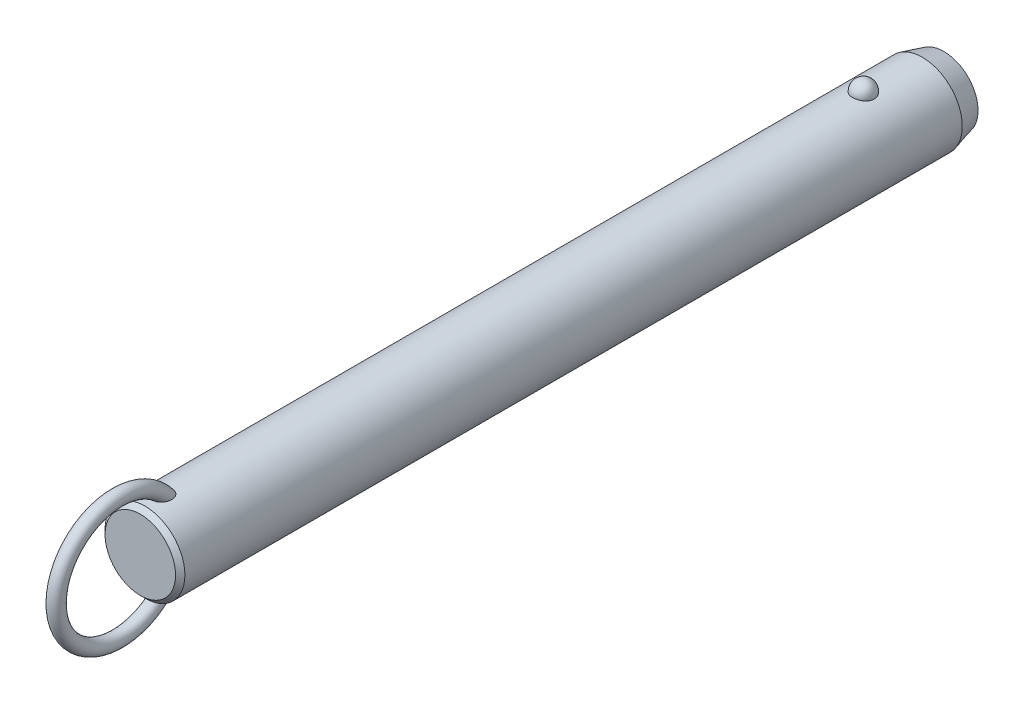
ISO-10303-21;
HEADER;
FILE_DESCRIPTION(('STEP AP214'),'2;1');
FILE_NAME('part.step','',(''),(''),'','','');
FILE_SCHEMA(('AUTOMOTIVE_DESIGN { 1 0 10303 214 1 1 1 1 }'));
ENDSEC;
DATA;
#1=APPLICATION_CONTEXT('core data for automotive mechanical design processes');
#2=APPLICATION_PROTOCOL_DEFINITION('international standard','automotive_design',2000,#1);
#3=PRODUCT_CONTEXT('',#1,'mechanical');
#4=PRODUCT('Part','Part','',(#3));
#5=PRODUCT_RELATED_PRODUCT_CATEGORY('part','',(#4));
#6=PRODUCT_DEFINITION_FORMATION('','',#4);
#7=PRODUCT_DEFINITION_CONTEXT('part definition',#1,'design');
#8=PRODUCT_DEFINITION('design','',#6,#7);
#9=PRODUCT_DEFINITION_SHAPE('','',#8);
#10=(LENGTH_UNIT() NAMED_UNIT(*) SI_UNIT(.MILLI.,.METRE.));
#11=(NAMED_UNIT(*) PLANE_ANGLE_UNIT() SI_UNIT($,.RADIAN.));
#12=(NAMED_UNIT(*) SI_UNIT($,.STERADIAN.) SOLID_ANGLE_UNIT());
#13=UNCERTAINTY_MEASURE_WITH_UNIT(LENGTH_MEASURE(1.E-05),#10,'distance_accuracy_value','');
#14=(GEOMETRIC_REPRESENTATION_CONTEXT(3) GLOBAL_UNCERTAINTY_ASSIGNED_CONTEXT((#13)) GLOBAL_UNIT_ASSIGNED_CONTEXT((#10,
#11,#12)) REPRESENTATION_CONTEXT('',''));
#15=CARTESIAN_POINT('',(0.,0.,0.));
#16=DIRECTION('',(0.,0.,1.));
#17=DIRECTION('',(1.,0.,0.));
#18=AXIS2_PLACEMENT_3D('',#15,#16,#17);
#19=CARTESIAN_POINT('',(0.,0.,185.4));
#20=DIRECTION('',(0.,0.,-1.));
#21=DIRECTION('',(-1.,0.,0.));
#22=AXIS2_PLACEMENT_3D('',#19,#20,#21);
#23=CYLINDRICAL_SURFACE('',#22,11.1);
#24=CARTESIAN_POINT('',(2.9724815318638,10.6945945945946,-3.00000000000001));
#25=CARTESIAN_POINT('',(2.9724783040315,10.6945972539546,-2.8322505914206));
#26=CARTESIAN_POINT('',(2.95876598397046,10.6984356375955,-2.66445972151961));
#27=CARTESIAN_POINT('',(2.90424529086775,10.7133624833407,-2.3336238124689));
#28=CARTESIAN_POINT('',(2.8634252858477,10.7244540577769,-2.17058084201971));
#29=CARTESIAN_POINT('',(2.75573657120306,10.7526272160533,-1.85396767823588));
#30=CARTESIAN_POINT('',(2.68887937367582,10.7697061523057,-1.70039333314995));
#31=CARTESIAN_POINT('',(2.53079696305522,10.8079438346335,-1.4069159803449));
#32=CARTESIAN_POINT('',(2.43957264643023,10.8291024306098,-1.26701246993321));
#33=CARTESIAN_POINT('',(2.23458150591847,10.8732541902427,-1.00409565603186));
#34=CARTESIAN_POINT('',(2.12071295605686,10.8962553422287,-0.88116297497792));
#35=CARTESIAN_POINT('',(1.87365402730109,10.9414421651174,-0.656352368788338));
#36=CARTESIAN_POINT('',(1.74046358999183,10.9636278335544,-0.554474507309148));
#37=CARTESIAN_POINT('',(1.45872188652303,11.0046495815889,-0.374872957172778));
#38=CARTESIAN_POINT('',(1.31021276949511,11.0234944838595,-0.297085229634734));
#39=CARTESIAN_POINT('',(1.00170030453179,11.0557957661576,-0.167529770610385));
#40=CARTESIAN_POINT('',(0.841698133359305,11.0692526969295,-0.115759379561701));
#41=CARTESIAN_POINT('',(0.51760779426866,11.0890932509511,-0.040392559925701));
#42=CARTESIAN_POINT('',(0.353633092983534,11.0955916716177,-0.0163383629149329));
#43=CARTESIAN_POINT('',(0.0238420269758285,11.1011989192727,0.0044517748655));
#44=CARTESIAN_POINT('',(-0.141974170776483,11.1003084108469,0.00119017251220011));
#45=CARTESIAN_POINT('',(-0.468405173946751,11.0912990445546,-0.0323233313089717));
#46=CARTESIAN_POINT('',(-0.629059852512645,11.0832767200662,-0.0622147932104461));
#47=CARTESIAN_POINT('',(-0.942937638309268,11.0609962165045,-0.147645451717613));
#48=CARTESIAN_POINT('',(-1.09616062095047,11.0467379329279,-0.20318507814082));
#49=CARTESIAN_POINT('',(-1.39181061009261,11.0134071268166,-0.338752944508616));
#50=CARTESIAN_POINT('',(-1.53417383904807,10.9943086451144,-0.418913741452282));
#51=CARTESIAN_POINT('',(-1.80342160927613,10.9533667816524,-0.601448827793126));
#52=CARTESIAN_POINT('',(-1.9303046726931,10.9315231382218,-0.703825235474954));
#53=CARTESIAN_POINT('',(-2.16747598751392,10.887005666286,-0.93009164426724));
#54=CARTESIAN_POINT('',(-2.27742774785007,10.8643239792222,-1.05433291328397));
#55=CARTESIAN_POINT('',(-2.47517316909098,10.8209886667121,-1.31966633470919));
#56=CARTESIAN_POINT('',(-2.56296538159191,10.8003351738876,-1.46075958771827));
#57=CARTESIAN_POINT('',(-2.71500300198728,10.7631304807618,-1.75753646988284));
#58=CARTESIAN_POINT('',(-2.77898901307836,10.7466250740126,-1.91335887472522));
#59=CARTESIAN_POINT('',(-2.88046189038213,10.7198747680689,-2.23391529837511));
#60=CARTESIAN_POINT('',(-2.91794947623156,10.709629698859,-2.3986490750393));
#61=CARTESIAN_POINT('',(-2.96537819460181,10.6965949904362,-2.73165170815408));
#62=CARTESIAN_POINT('',(-2.97542891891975,10.693775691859,-2.89990378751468));
#63=CARTESIAN_POINT('',(-2.96804271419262,10.6958279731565,-3.23575286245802));
#64=CARTESIAN_POINT('',(-2.95060646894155,10.7006993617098,-3.4033498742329));
#65=CARTESIAN_POINT('',(-2.88883358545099,10.71753912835,-3.73233906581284));
#66=CARTESIAN_POINT('',(-2.84462026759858,10.7294749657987,-3.89375610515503));
#67=CARTESIAN_POINT('',(-2.73050447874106,10.7590797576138,-4.20667949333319));
#68=CARTESIAN_POINT('',(-2.66060103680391,10.7767489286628,-4.35818546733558));
#69=CARTESIAN_POINT('',(-2.49642559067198,10.8159599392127,-4.64785421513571));
#70=CARTESIAN_POINT('',(-2.40203047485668,10.8375211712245,-4.78594458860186));
#71=CARTESIAN_POINT('',(-2.19143488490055,10.8820570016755,-5.04410382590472));
#72=CARTESIAN_POINT('',(-2.07523364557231,10.9050316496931,-5.16417205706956));
#73=CARTESIAN_POINT('',(-1.82361254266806,10.9499219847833,-5.3833483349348));
#74=CARTESIAN_POINT('',(-1.68812945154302,10.9718338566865,-5.48238464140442));
#75=CARTESIAN_POINT('',(-1.40191298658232,11.0120611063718,-5.65618873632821));
#76=CARTESIAN_POINT('',(-1.25118062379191,11.0303767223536,-5.73095813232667));
#77=CARTESIAN_POINT('',(-0.940570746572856,11.0611653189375,-5.85334725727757));
#78=CARTESIAN_POINT('',(-0.780821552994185,11.0737044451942,-5.90127578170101));
#79=CARTESIAN_POINT('',(-0.455204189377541,11.0918598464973,-5.9699297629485));
#80=CARTESIAN_POINT('',(-0.289336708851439,11.0974768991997,-5.99065827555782));
#81=CARTESIAN_POINT('',(0.0406846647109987,11.1011307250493,-6.00418773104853));
#82=CARTESIAN_POINT('',(0.204817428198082,11.099299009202,-5.99747318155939));
#83=CARTESIAN_POINT('',(0.5295530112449,11.088551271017,-5.95740317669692));
#84=CARTESIAN_POINT('',(0.690155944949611,11.0796354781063,-5.92404858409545));
#85=CARTESIAN_POINT('',(1.0027760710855,11.0557204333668,-5.83180084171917));
#86=CARTESIAN_POINT('',(1.15482001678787,11.0407414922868,-5.7729929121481));
#87=CARTESIAN_POINT('',(1.44678373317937,11.0062913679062,-5.63147366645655));
#88=CARTESIAN_POINT('',(1.58670279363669,10.9868199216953,-5.54876095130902));
#89=CARTESIAN_POINT('',(1.8527023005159,10.9451315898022,-5.36027644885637));
#90=CARTESIAN_POINT('',(1.97855158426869,10.9228788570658,-5.25418644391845));
#91=CARTESIAN_POINT('',(2.21080872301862,10.8782509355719,-5.02251354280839));
#92=CARTESIAN_POINT('',(2.31721312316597,10.8558757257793,-4.89692718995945));
#93=CARTESIAN_POINT('',(2.50945517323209,10.8130715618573,-4.62745408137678));
#94=CARTESIAN_POINT('',(2.59493284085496,10.7926798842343,-4.48330448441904));
#95=CARTESIAN_POINT('',(2.740862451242,10.7565495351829,-4.18236358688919));
#96=CARTESIAN_POINT('',(2.80132490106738,10.7408089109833,-4.02557762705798));
#97=CARTESIAN_POINT('',(2.88959070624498,10.7173718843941,-3.72475308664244));
#98=CARTESIAN_POINT('',(2.92062102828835,10.7088950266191,-3.58171216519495));
#99=CARTESIAN_POINT('',(2.96206765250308,10.6975052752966,-3.29245795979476));
#100=CARTESIAN_POINT('',(2.97248434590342,10.6945922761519,-3.14624473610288));
#101=CARTESIAN_POINT('',(2.9724815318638,10.6945945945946,-3.00000000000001));
#102=B_SPLINE_CURVE_WITH_KNOTS('',3,(#24,#25,#26,#27,#28,#29,#30,#31,#32,#33,#34,#35,#36,#37,
#38,#39,#40,#41,#42,#43,#44,#45,#46,#47,#48,#49,#50,#51,#52,#53,#54,#55,#56,#57,#58,#59,#60,#61,
#62,#63,#64,#65,#66,#67,#68,#69,#70,#71,#72,#73,#74,#75,#76,#77,#78,#79,#80,#81,#82,#83,#84,#85,
#86,#87,#88,#89,#90,#91,#92,#93,#94,#95,#96,#97,#98,#99,#100,#101),.UNSPECIFIED.,.T.,.F.,(4,2,2,
2,2,2,2,2,2,2,2,2,2,2,2,2,2,2,2,2,2,2,2,2,2,2,2,2,2,2,2,2,2,2,2,2,2,2,4),(0.,0.502722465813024,
1.00566079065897,1.5083769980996,2.01107471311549,2.51608392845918,3.02109467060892,
3.52475118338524,4.02835620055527,4.52351860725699,5.0186364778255,5.50715297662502,
5.99567766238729,6.48688002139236,6.97812923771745,7.47814366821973,7.97819077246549,
8.48353712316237,8.98886974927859,9.49218093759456,9.99547960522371,10.4964777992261,
10.997494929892,11.5010810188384,12.0046847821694,12.5099796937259,13.0152411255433,
13.5145635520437,14.0138298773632,14.5043200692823,14.9947943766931,15.4836390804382,
15.9725123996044,16.4685040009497,16.9645836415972,17.4686765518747,17.972557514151,
18.410841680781,18.849117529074),.UNSPECIFIED.);
#103=CARTESIAN_POINT('',(2.9724815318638,10.6945945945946,-3.00000000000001));
#104=VERTEX_POINT('',#103);
#105=EDGE_CURVE('E41',#104,#104,#102,.T.);
#106=ORIENTED_EDGE('',*,*,#105,.T.);
#107=EDGE_LOOP('',(#106));
#108=FACE_BOUND('',#107,.T.);
#109=CARTESIAN_POINT('',(0.,0.,196.8));
#110=DIRECTION('',(0.,0.,1.));
#111=DIRECTION('',(1.,0.,0.));
#112=AXIS2_PLACEMENT_3D('',#109,#110,#111);
#113=CIRCLE('',#112,11.1);
#114=CARTESIAN_POINT('',(11.1,0.,196.8));
#115=VERTEX_POINT('',#114);
#116=EDGE_CURVE('E10',#115,#115,#113,.F.);
#117=ORIENTED_EDGE('',*,*,#116,.T.);
#118=EDGE_LOOP('',(#117));
#119=FACE_BOUND('',#118,.T.);
#120=CARTESIAN_POINT('',(-0.564520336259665,-11.0856356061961,189.057815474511));
#121=CARTESIAN_POINT('',(-0.667202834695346,-11.0804062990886,189.091283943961));
#122=CARTESIAN_POINT('',(-0.766875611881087,-11.0738877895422,189.133835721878));
#123=CARTESIAN_POINT('',(-0.95728412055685,-11.0590576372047,189.235419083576));
#124=CARTESIAN_POINT('',(-1.04801616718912,-11.0507452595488,189.29445742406));
#125=CARTESIAN_POINT('',(-1.21800952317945,-11.0333016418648,189.426529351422));
#126=CARTESIAN_POINT('',(-1.2973080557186,-11.0241732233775,189.499515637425));
#127=CARTESIAN_POINT('',(-1.44337665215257,-11.0060026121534,189.657037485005));
#128=CARTESIAN_POINT('',(-1.51014622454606,-10.9969604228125,189.741573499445));
#129=CARTESIAN_POINT('',(-1.63454620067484,-10.9791841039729,189.925521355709));
#130=CARTESIAN_POINT('',(-1.69127003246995,-10.9705107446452,190.025549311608));
#131=CARTESIAN_POINT('',(-1.7898078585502,-10.9548648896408,190.232790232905));
#132=CARTESIAN_POINT('',(-1.83161214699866,-10.9478935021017,190.340007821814));
#133=CARTESIAN_POINT('',(-1.91557028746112,-10.9335803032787,190.605408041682));
#134=CARTESIAN_POINT('',(-1.95040620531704,-10.9273269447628,190.765980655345));
#135=CARTESIAN_POINT('',(-1.99388326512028,-10.9194709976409,191.090697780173));
#136=CARTESIAN_POINT('',(-2.00248051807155,-10.9178762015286,191.254847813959));
#137=CARTESIAN_POINT('',(-1.99551615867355,-10.9191578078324,191.624650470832));
#138=CARTESIAN_POINT('',(-1.97322066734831,-10.9232807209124,191.830191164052));
#139=CARTESIAN_POINT('',(-1.91529761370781,-10.9335244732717,192.133595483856));
#140=CARTESIAN_POINT('',(-1.89184575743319,-10.9376266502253,192.234088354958));
#141=CARTESIAN_POINT('',(-1.83700674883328,-10.9469720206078,192.432855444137));
#142=CARTESIAN_POINT('',(-1.80562070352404,-10.9522150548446,192.531129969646));
#143=CARTESIAN_POINT('',(-1.73463055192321,-10.9636837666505,192.725914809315));
#144=CARTESIAN_POINT('',(-1.69493416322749,-10.9699202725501,192.822390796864));
#145=CARTESIAN_POINT('',(-1.60745141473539,-10.9830806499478,193.011626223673));
#146=CARTESIAN_POINT('',(-1.55966150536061,-10.9900048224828,193.104384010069));
#147=CARTESIAN_POINT('',(-1.45591812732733,-11.0042280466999,193.284690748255));
#148=CARTESIAN_POINT('',(-1.40000013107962,-11.0115253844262,193.372260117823));
#149=CARTESIAN_POINT('',(-1.27937470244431,-11.0261911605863,193.541029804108));
#150=CARTESIAN_POINT('',(-1.21467835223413,-11.0335594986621,193.62223795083));
#151=CARTESIAN_POINT('',(-1.08218150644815,-11.0473027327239,193.769001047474));
#152=CARTESIAN_POINT('',(-1.01522633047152,-11.0537063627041,193.835309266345));
#153=CARTESIAN_POINT('',(-0.872952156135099,-11.065850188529,193.958378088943));
#154=CARTESIAN_POINT('',(-0.797642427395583,-11.0715911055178,194.015149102));
#155=CARTESIAN_POINT('',(-0.651396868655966,-11.081071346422,194.107515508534));
#156=CARTESIAN_POINT('',(-0.581712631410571,-11.0849841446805,194.145049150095));
#157=CARTESIAN_POINT('',(-0.437066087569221,-11.0916271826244,194.208259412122));
#158=CARTESIAN_POINT('',(-0.362109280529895,-11.0943586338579,194.233948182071));
#159=CARTESIAN_POINT('',(-0.207828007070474,-11.0983242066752,194.271117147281));
#160=CARTESIAN_POINT('',(-0.12846771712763,-11.0995432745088,194.282454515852));
#161=CARTESIAN_POINT('',(0.0309101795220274,-11.1002423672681,194.288965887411));
#162=CARTESIAN_POINT('',(0.110927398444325,-11.0997233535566,194.284148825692));
#163=CARTESIAN_POINT('',(0.256406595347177,-11.097240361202,194.260959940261));
#164=CARTESIAN_POINT('',(0.322235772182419,-11.0955074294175,194.244754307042));
#165=CARTESIAN_POINT('',(0.450635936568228,-11.0910350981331,194.202600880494));
#166=CARTESIAN_POINT('',(0.513205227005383,-11.0882951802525,194.176648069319));
#167=CARTESIAN_POINT('',(0.662626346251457,-11.0805620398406,194.102607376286));
#168=CARTESIAN_POINT('',(0.747127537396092,-11.0751144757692,194.049845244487));
#169=CARTESIAN_POINT('',(0.906756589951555,-11.0631932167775,193.931720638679));
#170=CARTESIAN_POINT('',(0.981859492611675,-11.0567168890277,193.866325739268));
#171=CARTESIAN_POINT('',(1.10712207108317,-11.0447856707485,193.74226337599));
#172=CARTESIAN_POINT('',(1.15909566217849,-11.0394280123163,193.685383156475));
#173=CARTESIAN_POINT('',(1.2579192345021,-11.0286040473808,193.567327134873));
#174=CARTESIAN_POINT('',(1.30476642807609,-11.0231376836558,193.506149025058));
#175=CARTESIAN_POINT('',(1.43818612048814,-11.0068027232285,193.317305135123));
#176=CARTESIAN_POINT('',(1.51751767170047,-10.9960104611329,193.184453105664));
#177=CARTESIAN_POINT('',(1.63597546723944,-10.9788847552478,192.953137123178));
#178=CARTESIAN_POINT('',(1.67988876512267,-10.9722190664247,192.857053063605));
#179=CARTESIAN_POINT('',(1.75953241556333,-10.9597298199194,192.661431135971));
#180=CARTESIAN_POINT('',(1.7952596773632,-10.9539065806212,192.561891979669));
#181=CARTESIAN_POINT('',(1.85844731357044,-10.9433632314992,192.36021118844));
#182=CARTESIAN_POINT('',(1.8859107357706,-10.9386427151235,192.25807052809));
#183=CARTESIAN_POINT('',(1.93234324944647,-10.9305350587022,192.051819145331));
#184=CARTESIAN_POINT('',(1.95131065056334,-10.9271481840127,191.947708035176));
#185=CARTESIAN_POINT('',(1.99040203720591,-10.9201183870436,191.665458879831));
#186=CARTESIAN_POINT('',(2.00221217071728,-10.9179256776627,191.486037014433));
#187=CARTESIAN_POINT('',(1.99711676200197,-10.9188636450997,191.127713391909));
#188=CARTESIAN_POINT('',(1.98026150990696,-10.9219849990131,190.948811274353));
#189=CARTESIAN_POINT('',(1.92151657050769,-10.9324473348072,190.63645144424));
#190=CARTESIAN_POINT('',(1.88605081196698,-10.9386915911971,190.501759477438));
#191=CARTESIAN_POINT('',(1.79393020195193,-10.9541780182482,190.239966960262));
#192=CARTESIAN_POINT('',(1.73729868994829,-10.9634168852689,190.112858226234));
#193=CARTESIAN_POINT('',(1.61237037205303,-10.9824218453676,189.889418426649));
#194=CARTESIAN_POINT('',(1.54715374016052,-10.9918945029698,189.791345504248));
#195=CARTESIAN_POINT('',(1.40127026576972,-11.0114415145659,189.607434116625));
#196=CARTESIAN_POINT('',(1.32060742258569,-11.0215157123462,189.521592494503));
#197=CARTESIAN_POINT('',(1.1447478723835,-11.041168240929,189.365163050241));
#198=CARTESIAN_POINT('',(1.04947805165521,-11.0507437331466,189.294656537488));
#199=CARTESIAN_POINT('',(0.847278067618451,-11.0680789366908,189.172640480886));
#200=CARTESIAN_POINT('',(0.740351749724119,-11.0758392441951,189.121124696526));
#201=CARTESIAN_POINT('',(0.529289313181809,-11.0878275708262,189.043485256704));
#202=CARTESIAN_POINT('',(0.425895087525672,-11.0923259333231,189.015377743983));
#203=CARTESIAN_POINT('',(0.215723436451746,-11.0984001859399,188.977703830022));
#204=CARTESIAN_POINT('',(0.10894793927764,-11.0999777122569,188.968127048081));
#205=CARTESIAN_POINT('',(-0.0938962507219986,-11.1000196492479,188.967877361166));
#206=CARTESIAN_POINT('',(-0.189967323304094,-11.0987797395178,188.975408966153));
#207=CARTESIAN_POINT('',(-0.379657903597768,-11.0939111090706,189.005507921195));
#208=CARTESIAN_POINT('',(-0.47327735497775,-11.0902823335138,189.028075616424));
#209=CARTESIAN_POINT('',(-0.564520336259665,-11.0856356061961,189.057815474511));
#210=B_SPLINE_CURVE_WITH_KNOTS('',3,(#120,#121,#122,#123,#124,#125,#126,#127,#128,#129,#130,
#131,#132,#133,#134,#135,#136,#137,#138,#139,#140,#141,#142,#143,#144,#145,#146,#147,#148,#149,
#150,#151,#152,#153,#154,#155,#156,#157,#158,#159,#160,#161,#162,#163,#164,#165,#166,#167,#168,
#169,#170,#171,#172,#173,#174,#175,#176,#177,#178,#179,#180,#181,#182,#183,#184,#185,#186,#187,
#188,#189,#190,#191,#192,#193,#194,#195,#196,#197,#198,#199,#200,#201,#202,#203,#204,#205,#206,
#207,#208,#209),.UNSPECIFIED.,.T.,.F.,(4,2,2,2,2,2,2,2,2,2,2,2,2,2,2,2,2,2,2,2,2,2,2,2,2,2,2,2,
2,2,2,2,2,2,2,2,2,2,2,2,2,2,2,2,4),(0.,0.323999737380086,0.64813245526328,0.971184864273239,
1.29424994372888,1.63886237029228,1.98369857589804,2.47426059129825,2.96564271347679,
3.58257396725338,3.89215258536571,4.20168803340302,4.51486273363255,4.82817514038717,
5.14015911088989,5.45175282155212,5.73442856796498,6.01679375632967,6.2536458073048,
6.49025437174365,6.72919963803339,6.96801276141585,7.17061258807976,7.37331685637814,
7.67094989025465,7.96935728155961,8.20075067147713,8.43226927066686,8.89581623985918,
9.21306533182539,9.53043400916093,9.84768549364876,10.1650000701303,10.7022930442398,
11.2386443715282,11.655339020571,12.071575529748,12.4245637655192,12.7774607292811,
13.1321855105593,13.4867936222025,13.8068771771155,14.1267813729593,14.4146787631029,
14.7025827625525),.UNSPECIFIED.);
#211=CARTESIAN_POINT('',(-0.564520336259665,-11.0856356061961,189.057815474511));
#212=VERTEX_POINT('',#211);
#213=EDGE_CURVE('E60',#212,#212,#210,.T.);
#214=ORIENTED_EDGE('',*,*,#213,.T.);
#215=EDGE_LOOP('',(#214));
#216=FACE_BOUND('',#215,.T.);
#217=CARTESIAN_POINT('',(-0.564520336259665,11.0856356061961,189.057815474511));
#218=CARTESIAN_POINT('',(-0.468542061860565,11.0905203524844,189.026545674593));
#219=CARTESIAN_POINT('',(-0.369793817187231,11.0942886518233,189.003157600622));
#220=CARTESIAN_POINT('',(-0.169555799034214,11.0991586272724,188.973085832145));
#221=CARTESIAN_POINT('',(-0.0680604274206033,11.1002543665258,188.96643932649));
#222=CARTESIAN_POINT('',(0.134549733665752,11.099646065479,188.970157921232));
#223=CARTESIAN_POINT('',(0.235664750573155,11.0979441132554,188.98051033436));
#224=CARTESIAN_POINT('',(0.434632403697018,11.0919342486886,189.017831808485));
#225=CARTESIAN_POINT('',(0.532486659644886,11.0876276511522,189.044792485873));
#226=CARTESIAN_POINT('',(0.722445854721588,11.0768742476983,189.1144096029));
#227=CARTESIAN_POINT('',(0.814543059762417,11.0704246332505,189.157086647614));
#228=CARTESIAN_POINT('',(0.990565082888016,11.0560659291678,189.256648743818));
#229=CARTESIAN_POINT('',(1.07448844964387,11.048156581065,189.313536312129));
#230=CARTESIAN_POINT('',(1.23562672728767,11.0313221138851,189.442210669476));
#231=CARTESIAN_POINT('',(1.3124268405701,11.0223686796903,189.514511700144));
#232=CARTESIAN_POINT('',(1.45398030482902,11.0045918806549,189.670042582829));
#233=CARTESIAN_POINT('',(1.51873073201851,10.9957685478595,189.753275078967));
#234=CARTESIAN_POINT('',(1.64107232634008,10.9782087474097,189.936384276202));
#235=CARTESIAN_POINT('',(1.6974317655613,10.9695572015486,190.037089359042));
#236=CARTESIAN_POINT('',(1.79515063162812,10.9539887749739,190.245626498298));
#237=CARTESIAN_POINT('',(1.83649966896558,10.9470730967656,190.35346343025));
#238=CARTESIAN_POINT('',(1.91931148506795,10.9329211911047,190.620399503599));
#239=CARTESIAN_POINT('',(1.95340104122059,10.9267904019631,190.781861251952));
#240=CARTESIAN_POINT('',(1.99526195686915,10.9192174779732,191.10821631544));
#241=CARTESIAN_POINT('',(2.00298989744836,10.9177830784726,191.27311484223));
#242=CARTESIAN_POINT('',(1.99396251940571,10.9194420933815,191.644100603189));
#243=CARTESIAN_POINT('',(1.97050829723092,10.923774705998,191.85003871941));
#244=CARTESIAN_POINT('',(1.91079643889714,10.9343131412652,192.153901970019));
#245=CARTESIAN_POINT('',(1.88673702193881,10.9385106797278,192.254529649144));
#246=CARTESIAN_POINT('',(1.83065508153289,10.9480376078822,192.453510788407));
#247=CARTESIAN_POINT('',(1.79863369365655,10.9533668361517,192.551864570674));
#248=CARTESIAN_POINT('',(1.72633365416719,10.9649954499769,192.746720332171));
#249=CARTESIAN_POINT('',(1.68596409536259,10.9713053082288,192.84318790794));
#250=CARTESIAN_POINT('',(1.59707998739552,10.9845964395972,193.032323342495));
#251=CARTESIAN_POINT('',(1.54856169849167,10.9915780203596,193.124989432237));
#252=CARTESIAN_POINT('',(1.44330168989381,11.0058935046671,193.304975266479));
#253=CARTESIAN_POINT('',(1.3865974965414,11.0132257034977,193.392316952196));
#254=CARTESIAN_POINT('',(1.26431158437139,11.0279330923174,193.560456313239));
#255=CARTESIAN_POINT('',(1.19874160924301,11.0353082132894,193.641262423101));
#256=CARTESIAN_POINT('',(1.06542088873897,11.048931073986,193.785985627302));
#257=CARTESIAN_POINT('',(0.998640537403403,11.0552153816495,193.850784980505));
#258=CARTESIAN_POINT('',(0.856896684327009,11.0671032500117,193.970846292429));
#259=CARTESIAN_POINT('',(0.781942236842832,11.0727075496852,194.026118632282));
#260=CARTESIAN_POINT('',(0.636276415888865,11.081949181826,194.115972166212));
#261=CARTESIAN_POINT('',(0.566755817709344,11.0857572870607,194.152441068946));
#262=CARTESIAN_POINT('',(0.422602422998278,11.0921860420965,194.213533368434));
#263=CARTESIAN_POINT('',(0.347974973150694,11.0948079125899,194.238168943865));
#264=CARTESIAN_POINT('',(0.194593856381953,11.0985608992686,194.273323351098));
#265=CARTESIAN_POINT('',(0.115807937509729,11.0996777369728,194.283706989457));
#266=CARTESIAN_POINT('',(-0.0422499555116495,11.1002003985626,194.288574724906));
#267=CARTESIAN_POINT('',(-0.121521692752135,11.09960699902,194.283066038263));
#268=CARTESIAN_POINT('',(-0.266046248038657,11.0970123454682,194.258827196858));
#269=CARTESIAN_POINT('',(-0.331661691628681,11.0952283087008,194.242135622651));
#270=CARTESIAN_POINT('',(-0.459588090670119,11.0906663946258,194.199111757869));
#271=CARTESIAN_POINT('',(-0.52189737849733,11.0878880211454,194.172774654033));
#272=CARTESIAN_POINT('',(-0.671446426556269,11.0800342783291,194.097513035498));
#273=CARTESIAN_POINT('',(-0.756250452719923,11.0744969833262,194.043818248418));
#274=CARTESIAN_POINT('',(-0.916349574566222,11.0624045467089,193.923802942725));
#275=CARTESIAN_POINT('',(-0.991618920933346,11.0558467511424,193.857449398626));
#276=CARTESIAN_POINT('',(-1.11713140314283,11.0437783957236,193.731633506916));
#277=CARTESIAN_POINT('',(-1.16920539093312,11.0383619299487,193.673952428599));
#278=CARTESIAN_POINT('',(-1.26817476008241,11.02743010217,193.554280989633));
#279=CARTESIAN_POINT('',(-1.31506731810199,11.0219146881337,193.492288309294));
#280=CARTESIAN_POINT('',(-1.40399813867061,11.0109399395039,193.364784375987));
#281=CARTESIAN_POINT('',(-1.44602864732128,11.0054807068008,193.299267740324));
#282=CARTESIAN_POINT('',(-1.52538779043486,10.9947621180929,193.165422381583));
#283=CARTESIAN_POINT('',(-1.56271516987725,10.9895028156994,193.097092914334));
#284=CARTESIAN_POINT('',(-1.64537943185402,10.9774790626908,192.933210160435));
#285=CARTESIAN_POINT('',(-1.68879497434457,10.9708503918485,192.8366735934));
#286=CARTESIAN_POINT('',(-1.76740738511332,10.9584602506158,192.640236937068));
#287=CARTESIAN_POINT('',(-1.80260120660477,10.95269910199,192.54033561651));
#288=CARTESIAN_POINT('',(-1.86468657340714,10.9423003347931,192.337966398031));
#289=CARTESIAN_POINT('',(-1.8915816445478,10.9376622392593,192.235499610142));
#290=CARTESIAN_POINT('',(-1.93682458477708,10.9297405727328,192.028642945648));
#291=CARTESIAN_POINT('',(-1.95517082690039,10.9264572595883,191.924252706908));
#292=CARTESIAN_POINT('',(-1.99232562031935,10.9197647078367,191.64262876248));
#293=CARTESIAN_POINT('',(-2.00294603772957,10.9177914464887,191.464185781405));
#294=CARTESIAN_POINT('',(-1.99566675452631,10.9191290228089,191.107996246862));
#295=CARTESIAN_POINT('',(-1.97781651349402,10.9224306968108,190.93024902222));
#296=CARTESIAN_POINT('',(-1.91747214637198,10.9331592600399,190.619792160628));
#297=CARTESIAN_POINT('',(-1.88131022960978,10.9395108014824,190.485825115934));
#298=CARTESIAN_POINT('',(-1.78790380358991,10.9551659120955,190.22559757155));
#299=CARTESIAN_POINT('',(-1.73068309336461,10.9644661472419,190.099328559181));
#300=CARTESIAN_POINT('',(-1.60475573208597,10.9835398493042,189.87741565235));
#301=CARTESIAN_POINT('',(-1.53908879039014,10.9930297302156,189.780026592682));
#302=CARTESIAN_POINT('',(-1.39238608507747,11.0125708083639,189.597525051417));
#303=CARTESIAN_POINT('',(-1.31135150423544,11.0226219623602,189.512411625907));
#304=CARTESIAN_POINT('',(-1.14382035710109,11.0411991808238,189.36529943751));
#305=CARTESIAN_POINT('',(-1.0585850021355,11.0497792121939,189.30186930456));
#306=CARTESIAN_POINT('',(-0.878723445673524,11.0655285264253,189.190250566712));
#307=CARTESIAN_POINT('',(-0.784123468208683,11.0727015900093,189.142020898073));
#308=CARTESIAN_POINT('',(-0.646163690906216,11.0812501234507,189.086023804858));
#309=CARTESIAN_POINT('',(-0.605595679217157,11.0835451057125,189.071197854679));
#310=CARTESIAN_POINT('',(-0.564520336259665,11.0856356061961,189.057815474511));
#311=B_SPLINE_CURVE_WITH_KNOTS('',3,(#217,#218,#219,#220,#221,#222,#223,#224,#225,#226,#227,
#228,#229,#230,#231,#232,#233,#234,#235,#236,#237,#238,#239,#240,#241,#242,#243,#244,#245,#246,
#247,#248,#249,#250,#251,#252,#253,#254,#255,#256,#257,#258,#259,#260,#261,#262,#263,#264,#265,
#266,#267,#268,#269,#270,#271,#272,#273,#274,#275,#276,#277,#278,#279,#280,#281,#282,#283,#284,
#285,#286,#287,#288,#289,#290,#291,#292,#293,#294,#295,#296,#297,#298,#299,#300,#301,#302,#303,
#304,#305,#306,#307,#308,#309,#310),.UNSPECIFIED.,.T.,.F.,(4,2,2,2,2,2,2,2,2,2,2,2,2,2,2,2,2,2,
2,2,2,2,2,2,2,2,2,2,2,2,2,2,2,2,2,2,2,2,2,2,2,2,2,2,2,2,4),(0.,0.303061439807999,
0.606795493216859,0.910302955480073,1.21365733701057,1.51741085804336,1.82121821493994,
2.13745205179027,2.45376252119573,2.79958678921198,3.14564996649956,3.63832391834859,
4.13180893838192,4.75031912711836,5.06071926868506,5.37107516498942,5.6850077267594,
5.99908475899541,6.31176519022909,6.62403542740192,6.90315673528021,7.18197194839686,
7.41687778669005,7.65154134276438,7.88841587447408,8.12518286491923,8.32752842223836,
8.52997509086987,8.82986421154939,9.13054668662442,9.36393502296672,9.5974499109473,
9.83133221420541,10.0652767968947,10.383032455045,10.7009056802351,11.0186436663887,
11.3364420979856,11.8705925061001,12.4038159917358,12.8189662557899,13.2336487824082,
13.5857049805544,13.9377340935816,14.2561354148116,14.5736690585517,14.7033687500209),.UNSPECIFIED.);
#312=CARTESIAN_POINT('',(-0.564520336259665,11.0856356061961,189.057815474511));
#313=VERTEX_POINT('',#312);
#314=EDGE_CURVE('E67',#313,#313,#311,.T.);
#315=ORIENTED_EDGE('',*,*,#314,.T.);
#316=EDGE_LOOP('',(#315));
#317=FACE_BOUND('',#316,.T.);
#318=CARTESIAN_POINT('',(0.,0.,-19.3999999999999));
#319=DIRECTION('',(0.,0.,-1.));
#320=DIRECTION('',(-1.,0.,0.));
#321=AXIS2_PLACEMENT_3D('',#318,#319,#320);
#322=CIRCLE('',#321,11.1);
#323=CARTESIAN_POINT('',(-11.1,0.,-19.3999999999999));
#324=VERTEX_POINT('',#323);
#325=EDGE_CURVE('E57',#324,#324,#322,.F.);
#326=ORIENTED_EDGE('',*,*,#325,.T.);
#327=EDGE_LOOP('',(#326));
#328=FACE_BOUND('',#327,.T.);
#329=ADVANCED_FACE('F37',(#108,#119,#216,#317,#328),#23,.T.);
#330=CARTESIAN_POINT('',(0.,0.,-25.4));
#331=DIRECTION('',(0.,0.,-1.));
#332=DIRECTION('',(-1.,0.,0.));
#333=AXIS2_PLACEMENT_3D('',#330,#331,#332);
#334=PLANE('',#333);
#335=CARTESIAN_POINT('',(0.,0.,-25.4));
#336=DIRECTION('',(0.,0.,-1.));
#337=DIRECTION('',(-1.,0.,0.));
#338=AXIS2_PLACEMENT_3D('',#335,#336,#337);
#339=CIRCLE('',#338,9.49230484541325);
#340=CARTESIAN_POINT('',(-9.49230484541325,0.,-25.4));
#341=VERTEX_POINT('',#340);
#342=EDGE_CURVE('E66',#341,#341,#339,.T.);
#343=ORIENTED_EDGE('',*,*,#342,.T.);
#344=EDGE_LOOP('',(#343));
#345=FACE_BOUND('',#344,.T.);
#346=ADVANCED_FACE('F85',(#345),#334,.T.);
#347=CARTESIAN_POINT('',(0.,0.,-25.4));
#348=DIRECTION('',(0.,0.,1.));
#349=DIRECTION('',(1.,0.,0.));
#350=AXIS2_PLACEMENT_3D('',#347,#348,#349);
#351=CONICAL_SURFACE('',#350,9.49230484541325,0.261799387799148);
#352=ORIENTED_EDGE('',*,*,#325,.F.);
#353=EDGE_LOOP('',(#352));
#354=FACE_BOUND('',#353,.T.);
#355=ORIENTED_EDGE('',*,*,#342,.F.);
#356=EDGE_LOOP('',(#355));
#357=FACE_BOUND('',#356,.T.);
#358=ADVANCED_FACE('F83',(#354,#357),#351,.T.);
#359=CARTESIAN_POINT('',(0.,0.,198.1));
#360=DIRECTION('',(0.,0.,1.));
#361=DIRECTION('',(1.,0.,0.));
#362=AXIS2_PLACEMENT_3D('',#359,#360,#361);
#363=PLANE('',#362);
#364=CARTESIAN_POINT('',(0.,0.,198.1));
#365=DIRECTION('',(0.,0.,1.));
#366=DIRECTION('',(1.,0.,0.));
#367=AXIS2_PLACEMENT_3D('',#364,#365,#366);
#368=CIRCLE('',#367,9.79999999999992);
#369=CARTESIAN_POINT('',(9.79999999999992,0.,198.1));
#370=VERTEX_POINT('',#369);
#371=EDGE_CURVE('E50',#370,#370,#368,.T.);
#372=ORIENTED_EDGE('',*,*,#371,.T.);
#373=EDGE_LOOP('',(#372));
#374=FACE_BOUND('',#373,.T.);
#375=ADVANCED_FACE('F77',(#374),#363,.T.);
#376=CARTESIAN_POINT('',(0.,0.,204.45));
#377=DIRECTION('',(1.,0.,0.));
#378=DIRECTION('',(0.,0.,-1.));
#379=AXIS2_PLACEMENT_3D('',#376,#377,#378);
#380=TOROIDAL_SURFACE('',#379,17.05,2.);
#381=ORIENTED_EDGE('',*,*,#314,.F.);
#382=EDGE_LOOP('',(#381));
#383=FACE_BOUND('',#382,.T.);
#384=ORIENTED_EDGE('',*,*,#213,.F.);
#385=EDGE_LOOP('',(#384));
#386=FACE_BOUND('',#385,.T.);
#387=ADVANCED_FACE('F73',(#383,#386),#380,.T.);
#388=CARTESIAN_POINT('',(0.,0.,198.1));
#389=DIRECTION('',(0.,0.,-1.));
#390=DIRECTION('',(-1.,0.,0.));
#391=AXIS2_PLACEMENT_3D('',#388,#389,#390);
#392=CONICAL_SURFACE('',#391,9.79999999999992,0.785398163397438);
#393=ORIENTED_EDGE('',*,*,#116,.F.);
#394=EDGE_LOOP('',(#393));
#395=FACE_BOUND('',#394,.T.);
#396=ORIENTED_EDGE('',*,*,#371,.F.);
#397=EDGE_LOOP('',(#396));
#398=FACE_BOUND('',#397,.T.);
#399=ADVANCED_FACE('F39',(#395,#398),#392,.T.);
#400=CARTESIAN_POINT('',(0.,11.1,-3.00000000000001));
#401=DIRECTION('',(0.,1.,0.));
#402=DIRECTION('',(0.,0.,-1.));
#403=AXIS2_PLACEMENT_3D('',#400,#401,#402);
#404=SPHERICAL_SURFACE('',#403,3.);
#405=ORIENTED_EDGE('',*,*,#105,.F.);
#406=EDGE_LOOP('',(#405));
#407=FACE_BOUND('',#406,.T.);
#408=ADVANCED_FACE('F79',(#407),#404,.T.);
#409=CLOSED_SHELL('',(#329,#346,#358,#375,#387,#399,#408));
#410=MANIFOLD_SOLID_BREP('B2',#409);
#411=ADVANCED_BREP_SHAPE_REPRESENTATION('',(#18,#410),#14);
#412=SHAPE_DEFINITION_REPRESENTATION(#9,#411);
ENDSEC;
END-ISO-10303-21;
